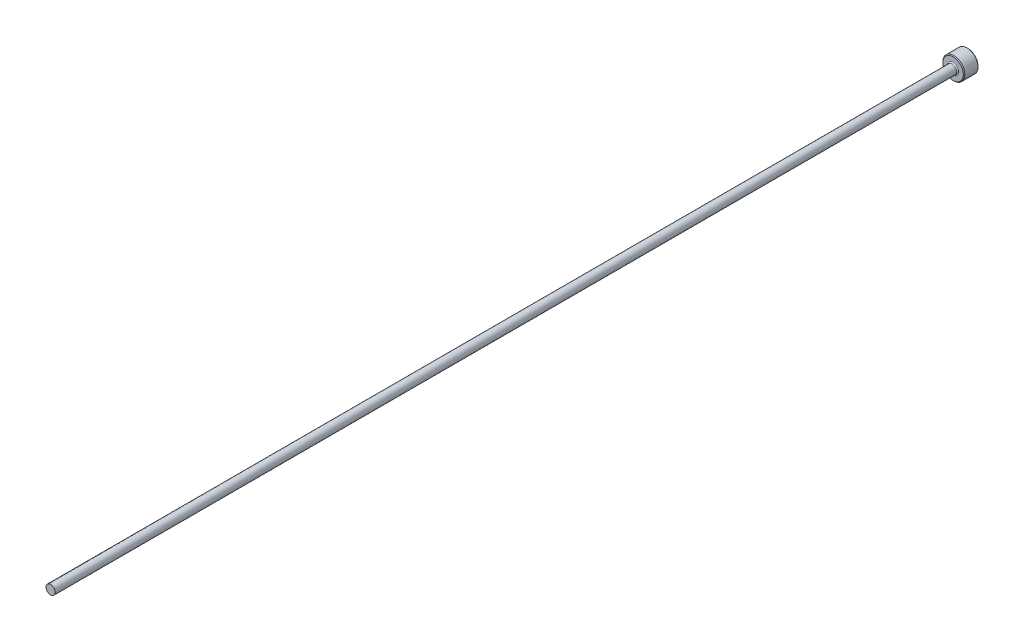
ISO-10303-21;
HEADER;
FILE_DESCRIPTION(('STEP AP214'),'2;1');
FILE_NAME('part.step','',(''),(''),'','','');
FILE_SCHEMA(('AUTOMOTIVE_DESIGN { 1 0 10303 214 1 1 1 1 }'));
ENDSEC;
DATA;
#1=APPLICATION_CONTEXT('core data for automotive mechanical design processes');
#2=APPLICATION_PROTOCOL_DEFINITION('international standard','automotive_design',2000,#1);
#3=PRODUCT_CONTEXT('',#1,'mechanical');
#4=PRODUCT('Part','Part','',(#3));
#5=PRODUCT_RELATED_PRODUCT_CATEGORY('part','',(#4));
#6=PRODUCT_DEFINITION_FORMATION('','',#4);
#7=PRODUCT_DEFINITION_CONTEXT('part definition',#1,'design');
#8=PRODUCT_DEFINITION('design','',#6,#7);
#9=PRODUCT_DEFINITION_SHAPE('','',#8);
#10=(LENGTH_UNIT() NAMED_UNIT(*) SI_UNIT(.MILLI.,.METRE.));
#11=(NAMED_UNIT(*) PLANE_ANGLE_UNIT() SI_UNIT($,.RADIAN.));
#12=(NAMED_UNIT(*) SI_UNIT($,.STERADIAN.) SOLID_ANGLE_UNIT());
#13=UNCERTAINTY_MEASURE_WITH_UNIT(LENGTH_MEASURE(1.E-05),#10,'distance_accuracy_value','');
#14=(GEOMETRIC_REPRESENTATION_CONTEXT(3) GLOBAL_UNCERTAINTY_ASSIGNED_CONTEXT((#13)) GLOBAL_UNIT_ASSIGNED_CONTEXT((#10,
#11,#12)) REPRESENTATION_CONTEXT('',''));
#15=CARTESIAN_POINT('',(0.,0.,0.));
#16=DIRECTION('',(0.,0.,1.));
#17=DIRECTION('',(1.,0.,0.));
#18=AXIS2_PLACEMENT_3D('',#15,#16,#17);
#19=CARTESIAN_POINT('',(0.,1.24999999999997,250.));
#20=DIRECTION('',(0.,0.,-1.));
#21=DIRECTION('',(-1.,0.,0.));
#22=AXIS2_PLACEMENT_3D('',#19,#20,#21);
#23=PLANE('',#22);
#24=CARTESIAN_POINT('',(0.,0.,250.));
#25=DIRECTION('',(0.,0.,1.));
#26=DIRECTION('',(1.,0.,0.));
#27=AXIS2_PLACEMENT_3D('',#24,#25,#26);
#28=CIRCLE('',#27,1.24999999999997);
#29=CARTESIAN_POINT('',(1.24999999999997,0.,250.));
#30=VERTEX_POINT('',#29);
#31=EDGE_CURVE('E50',#30,#30,#28,.T.);
#32=ORIENTED_EDGE('',*,*,#31,.T.);
#33=EDGE_LOOP('',(#32));
#34=FACE_BOUND('',#33,.T.);
#35=ADVANCED_FACE('F30',(#34),#23,.F.);
#36=CARTESIAN_POINT('',(0.,0.,109.050628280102));
#37=DIRECTION('',(0.,0.,1.));
#38=DIRECTION('',(1.,0.,0.));
#39=AXIS2_PLACEMENT_3D('',#36,#37,#38);
#40=CYLINDRICAL_SURFACE('',#39,1.24999999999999);
#41=ORIENTED_EDGE('',*,*,#31,.F.);
#42=EDGE_LOOP('',(#41));
#43=FACE_BOUND('',#42,.T.);
#44=CARTESIAN_POINT('',(0.,0.,4.3));
#45=DIRECTION('',(0.,0.,1.));
#46=DIRECTION('',(1.,0.,0.));
#47=AXIS2_PLACEMENT_3D('',#44,#45,#46);
#48=CIRCLE('',#47,1.25);
#49=CARTESIAN_POINT('',(1.25,0.,4.3));
#50=VERTEX_POINT('',#49);
#51=EDGE_CURVE('E53',#50,#50,#48,.T.);
#52=ORIENTED_EDGE('',*,*,#51,.T.);
#53=EDGE_LOOP('',(#52));
#54=FACE_BOUND('',#53,.T.);
#55=ADVANCED_FACE('F73',(#43,#54),#40,.T.);
#56=CARTESIAN_POINT('',(0.,0.,4.3));
#57=DIRECTION('',(0.,0.,1.));
#58=DIRECTION('',(1.,0.,0.));
#59=AXIS2_PLACEMENT_3D('',#56,#57,#58);
#60=TOROIDAL_SURFACE('',#59,1.55,0.3);
#61=ORIENTED_EDGE('',*,*,#51,.F.);
#62=EDGE_LOOP('',(#61));
#63=FACE_BOUND('',#62,.T.);
#64=CARTESIAN_POINT('',(0.,0.,4.));
#65=DIRECTION('',(0.,0.,1.));
#66=DIRECTION('',(1.,0.,0.));
#67=AXIS2_PLACEMENT_3D('',#64,#65,#66);
#68=CIRCLE('',#67,1.55);
#69=CARTESIAN_POINT('',(1.55,0.,4.));
#70=VERTEX_POINT('',#69);
#71=EDGE_CURVE('E56',#70,#70,#68,.T.);
#72=ORIENTED_EDGE('',*,*,#71,.T.);
#73=EDGE_LOOP('',(#72));
#74=FACE_BOUND('',#73,.T.);
#75=ADVANCED_FACE('F60',(#63,#74),#60,.F.);
#76=CARTESIAN_POINT('',(0.,3.,4.));
#77=DIRECTION('',(0.,0.,-1.));
#78=DIRECTION('',(-1.,0.,0.));
#79=AXIS2_PLACEMENT_3D('',#76,#77,#78);
#80=PLANE('',#79);
#81=CARTESIAN_POINT('',(0.,0.,4.));
#82=DIRECTION('',(0.,0.,-1.));
#83=DIRECTION('',(-1.,0.,0.));
#84=AXIS2_PLACEMENT_3D('',#81,#82,#83);
#85=CIRCLE('',#84,2.8);
#86=CARTESIAN_POINT('',(-2.8,0.,4.));
#87=VERTEX_POINT('',#86);
#88=EDGE_CURVE('E10',#87,#87,#85,.F.);
#89=ORIENTED_EDGE('',*,*,#88,.T.);
#90=EDGE_LOOP('',(#89));
#91=FACE_BOUND('',#90,.T.);
#92=ORIENTED_EDGE('',*,*,#71,.F.);
#93=EDGE_LOOP('',(#92));
#94=FACE_BOUND('',#93,.T.);
#95=ADVANCED_FACE('F62',(#91,#94),#80,.F.);
#96=CARTESIAN_POINT('',(0.,0.,109.050628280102));
#97=DIRECTION('',(0.,0.,1.));
#98=DIRECTION('',(1.,0.,0.));
#99=AXIS2_PLACEMENT_3D('',#96,#97,#98);
#100=CYLINDRICAL_SURFACE('',#99,3.);
#101=CARTESIAN_POINT('',(0.,0.,0.20000000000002));
#102=DIRECTION('',(0.,0.,1.));
#103=DIRECTION('',(1.,0.,0.));
#104=AXIS2_PLACEMENT_3D('',#101,#102,#103);
#105=CIRCLE('',#104,3.);
#106=CARTESIAN_POINT('',(3.,0.,0.20000000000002));
#107=VERTEX_POINT('',#106);
#108=EDGE_CURVE('E41',#107,#107,#105,.T.);
#109=ORIENTED_EDGE('',*,*,#108,.T.);
#110=EDGE_LOOP('',(#109));
#111=FACE_BOUND('',#110,.T.);
#112=CARTESIAN_POINT('',(0.,0.,3.80000000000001));
#113=DIRECTION('',(0.,0.,-1.));
#114=DIRECTION('',(-1.,0.,0.));
#115=AXIS2_PLACEMENT_3D('',#112,#113,#114);
#116=CIRCLE('',#115,3.);
#117=CARTESIAN_POINT('',(-3.,0.,3.80000000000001));
#118=VERTEX_POINT('',#117);
#119=EDGE_CURVE('E45',#118,#118,#116,.T.);
#120=ORIENTED_EDGE('',*,*,#119,.T.);
#121=EDGE_LOOP('',(#120));
#122=FACE_BOUND('',#121,.T.);
#123=ADVANCED_FACE('F64',(#111,#122),#100,.T.);
#124=CARTESIAN_POINT('',(0.,0.,0.));
#125=DIRECTION('',(0.,0.,1.));
#126=DIRECTION('',(1.,0.,0.));
#127=AXIS2_PLACEMENT_3D('',#124,#125,#126);
#128=PLANE('',#127);
#129=CARTESIAN_POINT('',(0.,0.,0.));
#130=DIRECTION('',(0.,0.,1.));
#131=DIRECTION('',(1.,0.,0.));
#132=AXIS2_PLACEMENT_3D('',#129,#130,#131);
#133=CIRCLE('',#132,2.79999999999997);
#134=CARTESIAN_POINT('',(2.79999999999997,0.,0.));
#135=VERTEX_POINT('',#134);
#136=EDGE_CURVE('E37',#135,#135,#133,.F.);
#137=ORIENTED_EDGE('',*,*,#136,.T.);
#138=EDGE_LOOP('',(#137));
#139=FACE_BOUND('',#138,.T.);
#140=ADVANCED_FACE('F70',(#139),#128,.F.);
#141=CARTESIAN_POINT('',(0.,0.,0.20000000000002));
#142=DIRECTION('',(0.,0.,1.));
#143=DIRECTION('',(1.,0.,0.));
#144=AXIS2_PLACEMENT_3D('',#141,#142,#143);
#145=CONICAL_SURFACE('',#144,3.,0.785398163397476);
#146=ORIENTED_EDGE('',*,*,#136,.F.);
#147=EDGE_LOOP('',(#146));
#148=FACE_BOUND('',#147,.T.);
#149=ORIENTED_EDGE('',*,*,#108,.F.);
#150=EDGE_LOOP('',(#149));
#151=FACE_BOUND('',#150,.T.);
#152=ADVANCED_FACE('F84',(#148,#151),#145,.T.);
#153=CARTESIAN_POINT('',(0.,0.,4.));
#154=DIRECTION('',(0.,0.,-1.));
#155=DIRECTION('',(-1.,0.,0.));
#156=AXIS2_PLACEMENT_3D('',#153,#154,#155);
#157=CONICAL_SURFACE('',#156,2.8,0.785398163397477);
#158=ORIENTED_EDGE('',*,*,#119,.F.);
#159=EDGE_LOOP('',(#158));
#160=FACE_BOUND('',#159,.T.);
#161=ORIENTED_EDGE('',*,*,#88,.F.);
#162=EDGE_LOOP('',(#161));
#163=FACE_BOUND('',#162,.T.);
#164=ADVANCED_FACE('F32',(#160,#163),#157,.T.);
#165=CLOSED_SHELL('',(#35,#55,#75,#95,#123,#140,#152,#164));
#166=MANIFOLD_SOLID_BREP('B2',#165);
#167=ADVANCED_BREP_SHAPE_REPRESENTATION('',(#18,#166),#14);
#168=SHAPE_DEFINITION_REPRESENTATION(#9,#167);
ENDSEC;
END-ISO-10303-21;
